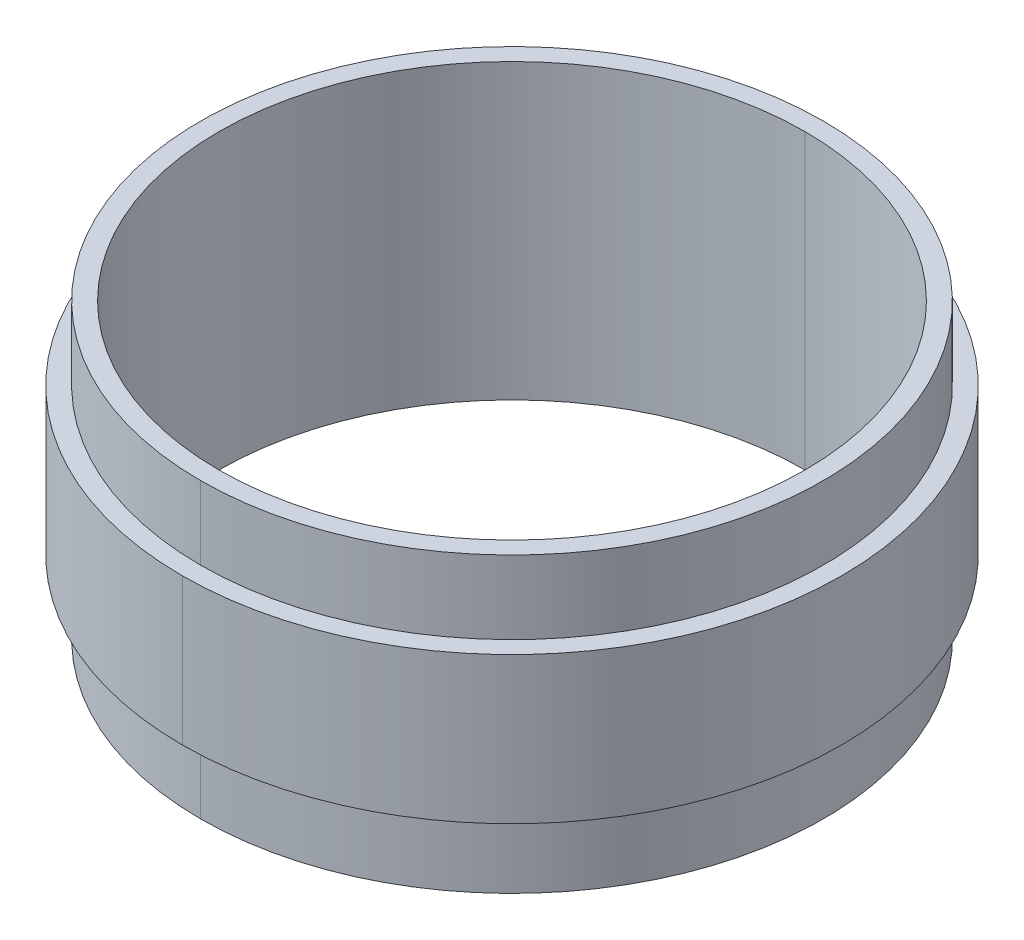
ISO-10303-21;
HEADER;
FILE_DESCRIPTION(('STEP AP214'),'2;1');
FILE_NAME('part.step','',(''),(''),'','','');
FILE_SCHEMA(('AUTOMOTIVE_DESIGN { 1 0 10303 214 1 1 1 1 }'));
ENDSEC;
DATA;
#1=APPLICATION_CONTEXT('core data for automotive mechanical design processes');
#2=APPLICATION_PROTOCOL_DEFINITION('international standard','automotive_design',2000,#1);
#3=PRODUCT_CONTEXT('',#1,'mechanical');
#4=PRODUCT('Part','Part','',(#3));
#5=PRODUCT_RELATED_PRODUCT_CATEGORY('part','',(#4));
#6=PRODUCT_DEFINITION_FORMATION('','',#4);
#7=PRODUCT_DEFINITION_CONTEXT('part definition',#1,'design');
#8=PRODUCT_DEFINITION('design','',#6,#7);
#9=PRODUCT_DEFINITION_SHAPE('','',#8);
#10=(LENGTH_UNIT() NAMED_UNIT(*) SI_UNIT(.MILLI.,.METRE.));
#11=(NAMED_UNIT(*) PLANE_ANGLE_UNIT() SI_UNIT($,.RADIAN.));
#12=(NAMED_UNIT(*) SI_UNIT($,.STERADIAN.) SOLID_ANGLE_UNIT());
#13=UNCERTAINTY_MEASURE_WITH_UNIT(LENGTH_MEASURE(1.E-05),#10,'distance_accuracy_value','');
#14=(GEOMETRIC_REPRESENTATION_CONTEXT(3) GLOBAL_UNCERTAINTY_ASSIGNED_CONTEXT((#13)) GLOBAL_UNIT_ASSIGNED_CONTEXT((#10,
#11,#12)) REPRESENTATION_CONTEXT('',''));
#15=CARTESIAN_POINT('',(0.,0.,0.));
#16=DIRECTION('',(0.,0.,1.));
#17=DIRECTION('',(1.,0.,0.));
#18=AXIS2_PLACEMENT_3D('',#15,#16,#17);
#19=CARTESIAN_POINT('',(0.,-500.,0.));
#20=DIRECTION('',(0.,-1.,0.));
#21=DIRECTION('',(0.,0.,-1.));
#22=AXIS2_PLACEMENT_3D('',#19,#20,#21);
#23=CYLINDRICAL_SURFACE('',#22,8.5);
#24=DIRECTION('',(0.,-1.,0.));
#25=VECTOR('',#24,1.);
#26=CARTESIAN_POINT('',(0.,-500.,8.5));
#27=LINE('',#26,#25);
#28=CARTESIAN_POINT('',(0.,-78.,8.5));
#29=VERTEX_POINT('',#28);
#30=CARTESIAN_POINT('',(0.,-80.,8.5));
#31=VERTEX_POINT('',#30);
#32=EDGE_CURVE('E174',#29,#31,#27,.T.);
#33=ORIENTED_EDGE('',*,*,#32,.F.);
#34=CARTESIAN_POINT('',(0.,-78.,0.));
#35=DIRECTION('',(0.,-1.,0.));
#36=DIRECTION('',(0.,0.,-1.));
#37=AXIS2_PLACEMENT_3D('',#34,#35,#36);
#38=CIRCLE('',#37,8.5);
#39=CARTESIAN_POINT('',(0.,-78.,-8.5));
#40=VERTEX_POINT('',#39);
#41=EDGE_CURVE('E10',#29,#40,#38,.T.);
#42=ORIENTED_EDGE('',*,*,#41,.T.);
#43=DIRECTION('',(0.,-1.,0.));
#44=VECTOR('',#43,1.);
#45=CARTESIAN_POINT('',(0.,-500.,-8.5));
#46=LINE('',#45,#44);
#47=CARTESIAN_POINT('',(0.,-80.,-8.5));
#48=VERTEX_POINT('',#47);
#49=EDGE_CURVE('E161',#40,#48,#46,.T.);
#50=ORIENTED_EDGE('',*,*,#49,.T.);
#51=CARTESIAN_POINT('',(0.,-80.,0.));
#52=DIRECTION('',(0.,-1.,0.));
#53=DIRECTION('',(0.,0.,-1.));
#54=AXIS2_PLACEMENT_3D('',#51,#52,#53);
#55=CIRCLE('',#54,8.5);
#56=EDGE_CURVE('E130',#31,#48,#55,.T.);
#57=ORIENTED_EDGE('',*,*,#56,.F.);
#58=EDGE_LOOP('',(#33,#42,#50,#57));
#59=FACE_BOUND('',#58,.T.);
#60=ADVANCED_FACE('F16',(#59),#23,.T.);
#61=CARTESIAN_POINT('',(9.,-78.,0.));
#62=DIRECTION('',(0.,-1.,0.));
#63=DIRECTION('',(-1.,0.,0.));
#64=AXIS2_PLACEMENT_3D('',#61,#62,#63);
#65=PLANE('',#64);
#66=CARTESIAN_POINT('',(0.,-78.,0.));
#67=DIRECTION('',(0.,-1.,0.));
#68=DIRECTION('',(0.,0.,-1.));
#69=AXIS2_PLACEMENT_3D('',#66,#67,#68);
#70=CIRCLE('',#69,8.5);
#71=EDGE_CURVE('E20',#40,#29,#70,.T.);
#72=ORIENTED_EDGE('',*,*,#71,.F.);
#73=ORIENTED_EDGE('',*,*,#41,.F.);
#74=EDGE_LOOP('',(#72,#73));
#75=FACE_BOUND('',#74,.T.);
#76=CARTESIAN_POINT('',(0.,-78.,0.));
#77=DIRECTION('',(0.,-1.,0.));
#78=DIRECTION('',(0.,0.,-1.));
#79=AXIS2_PLACEMENT_3D('',#76,#77,#78);
#80=CIRCLE('',#79,9.);
#81=CARTESIAN_POINT('',(0.,-78.,-9.));
#82=VERTEX_POINT('',#81);
#83=CARTESIAN_POINT('',(0.,-78.,9.));
#84=VERTEX_POINT('',#83);
#85=EDGE_CURVE('E126',#82,#84,#80,.T.);
#86=ORIENTED_EDGE('',*,*,#85,.T.);
#87=CARTESIAN_POINT('',(0.,-78.,0.));
#88=DIRECTION('',(0.,-1.,0.));
#89=DIRECTION('',(0.,0.,-1.));
#90=AXIS2_PLACEMENT_3D('',#87,#88,#89);
#91=CIRCLE('',#90,9.);
#92=EDGE_CURVE('E27',#84,#82,#91,.T.);
#93=ORIENTED_EDGE('',*,*,#92,.T.);
#94=EDGE_LOOP('',(#86,#93));
#95=FACE_BOUND('',#94,.T.);
#96=ADVANCED_FACE('F195',(#75,#95),#65,.T.);
#97=CARTESIAN_POINT('',(0.,-500.,0.));
#98=DIRECTION('',(0.,-1.,0.));
#99=DIRECTION('',(0.,0.,-1.));
#100=AXIS2_PLACEMENT_3D('',#97,#98,#99);
#101=CYLINDRICAL_SURFACE('',#100,9.);
#102=DIRECTION('',(0.,-1.,0.));
#103=VECTOR('',#102,1.);
#104=CARTESIAN_POINT('',(0.,-500.,9.));
#105=LINE('',#104,#103);
#106=CARTESIAN_POINT('',(0.,-74.,9.));
#107=VERTEX_POINT('',#106);
#108=EDGE_CURVE('E140',#107,#84,#105,.T.);
#109=ORIENTED_EDGE('',*,*,#108,.F.);
#110=CARTESIAN_POINT('',(0.,-74.,0.));
#111=DIRECTION('',(0.,-1.,0.));
#112=DIRECTION('',(0.,0.,-1.));
#113=AXIS2_PLACEMENT_3D('',#110,#111,#112);
#114=CIRCLE('',#113,9.);
#115=CARTESIAN_POINT('',(0.,-74.,-9.));
#116=VERTEX_POINT('',#115);
#117=EDGE_CURVE('E169',#107,#116,#114,.T.);
#118=ORIENTED_EDGE('',*,*,#117,.T.);
#119=DIRECTION('',(0.,-1.,0.));
#120=VECTOR('',#119,1.);
#121=CARTESIAN_POINT('',(0.,-500.,-9.));
#122=LINE('',#121,#120);
#123=EDGE_CURVE('E117',#116,#82,#122,.T.);
#124=ORIENTED_EDGE('',*,*,#123,.T.);
#125=ORIENTED_EDGE('',*,*,#92,.F.);
#126=EDGE_LOOP('',(#109,#118,#124,#125));
#127=FACE_BOUND('',#126,.T.);
#128=ADVANCED_FACE('F193',(#127),#101,.T.);
#129=CARTESIAN_POINT('',(8.5,-74.,0.));
#130=DIRECTION('',(0.,1.,0.));
#131=DIRECTION('',(0.,0.,-1.));
#132=AXIS2_PLACEMENT_3D('',#129,#130,#131);
#133=PLANE('',#132);
#134=CARTESIAN_POINT('',(0.,-74.,0.));
#135=DIRECTION('',(0.,-1.,0.));
#136=DIRECTION('',(0.,0.,-1.));
#137=AXIS2_PLACEMENT_3D('',#134,#135,#136);
#138=CIRCLE('',#137,9.);
#139=EDGE_CURVE('E164',#116,#107,#138,.T.);
#140=ORIENTED_EDGE('',*,*,#139,.F.);
#141=ORIENTED_EDGE('',*,*,#117,.F.);
#142=EDGE_LOOP('',(#140,#141));
#143=FACE_BOUND('',#142,.T.);
#144=CARTESIAN_POINT('',(0.,-74.,0.));
#145=DIRECTION('',(0.,-1.,0.));
#146=DIRECTION('',(0.,0.,-1.));
#147=AXIS2_PLACEMENT_3D('',#144,#145,#146);
#148=CIRCLE('',#147,8.5);
#149=CARTESIAN_POINT('',(0.,-74.,-8.5));
#150=VERTEX_POINT('',#149);
#151=CARTESIAN_POINT('',(0.,-74.,8.5));
#152=VERTEX_POINT('',#151);
#153=EDGE_CURVE('E110',#150,#152,#148,.T.);
#154=ORIENTED_EDGE('',*,*,#153,.T.);
#155=CARTESIAN_POINT('',(0.,-74.,0.));
#156=DIRECTION('',(0.,-1.,0.));
#157=DIRECTION('',(0.,0.,-1.));
#158=AXIS2_PLACEMENT_3D('',#155,#156,#157);
#159=CIRCLE('',#158,8.5);
#160=EDGE_CURVE('E103',#152,#150,#159,.T.);
#161=ORIENTED_EDGE('',*,*,#160,.T.);
#162=EDGE_LOOP('',(#154,#161));
#163=FACE_BOUND('',#162,.T.);
#164=ADVANCED_FACE('F204',(#143,#163),#133,.T.);
#165=CARTESIAN_POINT('',(0.,-500.,0.));
#166=DIRECTION('',(0.,-1.,0.));
#167=DIRECTION('',(0.,0.,-1.));
#168=AXIS2_PLACEMENT_3D('',#165,#166,#167);
#169=CYLINDRICAL_SURFACE('',#168,8.5);
#170=DIRECTION('',(0.,-1.,0.));
#171=VECTOR('',#170,1.);
#172=CARTESIAN_POINT('',(0.,-500.,8.5));
#173=LINE('',#172,#171);
#174=CARTESIAN_POINT('',(0.,-72.,8.5));
#175=VERTEX_POINT('',#174);
#176=EDGE_CURVE('E98',#175,#152,#173,.T.);
#177=ORIENTED_EDGE('',*,*,#176,.F.);
#178=CARTESIAN_POINT('',(0.,-72.,0.));
#179=DIRECTION('',(0.,-1.,0.));
#180=DIRECTION('',(0.,0.,-1.));
#181=AXIS2_PLACEMENT_3D('',#178,#179,#180);
#182=CIRCLE('',#181,8.5);
#183=CARTESIAN_POINT('',(0.,-72.,-8.5));
#184=VERTEX_POINT('',#183);
#185=EDGE_CURVE('E91',#175,#184,#182,.T.);
#186=ORIENTED_EDGE('',*,*,#185,.T.);
#187=DIRECTION('',(0.,-1.,0.));
#188=VECTOR('',#187,1.);
#189=CARTESIAN_POINT('',(0.,-500.,-8.5));
#190=LINE('',#189,#188);
#191=EDGE_CURVE('E95',#184,#150,#190,.T.);
#192=ORIENTED_EDGE('',*,*,#191,.T.);
#193=ORIENTED_EDGE('',*,*,#160,.F.);
#194=EDGE_LOOP('',(#177,#186,#192,#193));
#195=FACE_BOUND('',#194,.T.);
#196=ADVANCED_FACE('F93',(#195),#169,.T.);
#197=CARTESIAN_POINT('',(8.,-72.,0.));
#198=DIRECTION('',(0.,1.,0.));
#199=DIRECTION('',(0.,0.,-1.));
#200=AXIS2_PLACEMENT_3D('',#197,#198,#199);
#201=PLANE('',#200);
#202=CARTESIAN_POINT('',(0.,-72.,0.));
#203=DIRECTION('',(0.,-1.,0.));
#204=DIRECTION('',(0.,0.,-1.));
#205=AXIS2_PLACEMENT_3D('',#202,#203,#204);
#206=CIRCLE('',#205,8.5);
#207=EDGE_CURVE('E108',#184,#175,#206,.T.);
#208=ORIENTED_EDGE('',*,*,#207,.F.);
#209=ORIENTED_EDGE('',*,*,#185,.F.);
#210=EDGE_LOOP('',(#208,#209));
#211=FACE_BOUND('',#210,.T.);
#212=CARTESIAN_POINT('',(0.,-72.,0.));
#213=DIRECTION('',(0.,-1.,0.));
#214=DIRECTION('',(0.,0.,-1.));
#215=AXIS2_PLACEMENT_3D('',#212,#213,#214);
#216=CIRCLE('',#215,8.);
#217=CARTESIAN_POINT('',(0.,-72.,-8.));
#218=VERTEX_POINT('',#217);
#219=CARTESIAN_POINT('',(0.,-72.,8.));
#220=VERTEX_POINT('',#219);
#221=EDGE_CURVE('E104',#218,#220,#216,.T.);
#222=ORIENTED_EDGE('',*,*,#221,.T.);
#223=CARTESIAN_POINT('',(0.,-72.,0.));
#224=DIRECTION('',(0.,-1.,0.));
#225=DIRECTION('',(0.,0.,-1.));
#226=AXIS2_PLACEMENT_3D('',#223,#224,#225);
#227=CIRCLE('',#226,8.);
#228=EDGE_CURVE('E112',#220,#218,#227,.T.);
#229=ORIENTED_EDGE('',*,*,#228,.T.);
#230=EDGE_LOOP('',(#222,#229));
#231=FACE_BOUND('',#230,.T.);
#232=ADVANCED_FACE('F114',(#211,#231),#201,.T.);
#233=CARTESIAN_POINT('',(0.,-500.,0.));
#234=DIRECTION('',(0.,-1.,0.));
#235=DIRECTION('',(0.,0.,-1.));
#236=AXIS2_PLACEMENT_3D('',#233,#234,#235);
#237=CYLINDRICAL_SURFACE('',#236,8.);
#238=DIRECTION('',(0.,-1.,0.));
#239=VECTOR('',#238,1.);
#240=CARTESIAN_POINT('',(0.,-500.,8.));
#241=LINE('',#240,#239);
#242=CARTESIAN_POINT('',(0.,-80.,8.));
#243=VERTEX_POINT('',#242);
#244=EDGE_CURVE('E135',#220,#243,#241,.T.);
#245=ORIENTED_EDGE('',*,*,#244,.F.);
#246=ORIENTED_EDGE('',*,*,#221,.F.);
#247=DIRECTION('',(0.,-1.,0.));
#248=VECTOR('',#247,1.);
#249=CARTESIAN_POINT('',(0.,-500.,-8.));
#250=LINE('',#249,#248);
#251=CARTESIAN_POINT('',(0.,-80.,-8.));
#252=VERTEX_POINT('',#251);
#253=EDGE_CURVE('E141',#218,#252,#250,.T.);
#254=ORIENTED_EDGE('',*,*,#253,.T.);
#255=CARTESIAN_POINT('',(0.,-80.,0.));
#256=DIRECTION('',(0.,-1.,0.));
#257=DIRECTION('',(0.,0.,-1.));
#258=AXIS2_PLACEMENT_3D('',#255,#256,#257);
#259=CIRCLE('',#258,8.);
#260=EDGE_CURVE('E40',#252,#243,#259,.T.);
#261=ORIENTED_EDGE('',*,*,#260,.T.);
#262=EDGE_LOOP('',(#245,#246,#254,#261));
#263=FACE_BOUND('',#262,.T.);
#264=ADVANCED_FACE('F211',(#263),#237,.F.);
#265=CARTESIAN_POINT('',(8.5,-80.,0.));
#266=DIRECTION('',(0.,-1.,0.));
#267=DIRECTION('',(-1.,0.,0.));
#268=AXIS2_PLACEMENT_3D('',#265,#266,#267);
#269=PLANE('',#268);
#270=ORIENTED_EDGE('',*,*,#260,.F.);
#271=CARTESIAN_POINT('',(0.,-80.,0.));
#272=DIRECTION('',(0.,-1.,0.));
#273=DIRECTION('',(0.,0.,-1.));
#274=AXIS2_PLACEMENT_3D('',#271,#272,#273);
#275=CIRCLE('',#274,8.);
#276=EDGE_CURVE('E144',#243,#252,#275,.T.);
#277=ORIENTED_EDGE('',*,*,#276,.F.);
#278=EDGE_LOOP('',(#270,#277));
#279=FACE_BOUND('',#278,.T.);
#280=CARTESIAN_POINT('',(0.,-80.,0.));
#281=DIRECTION('',(0.,-1.,0.));
#282=DIRECTION('',(0.,0.,-1.));
#283=AXIS2_PLACEMENT_3D('',#280,#281,#282);
#284=CIRCLE('',#283,8.5);
#285=EDGE_CURVE('E165',#48,#31,#284,.T.);
#286=ORIENTED_EDGE('',*,*,#285,.T.);
#287=ORIENTED_EDGE('',*,*,#56,.T.);
#288=EDGE_LOOP('',(#286,#287));
#289=FACE_BOUND('',#288,.T.);
#290=ADVANCED_FACE('F210',(#279,#289),#269,.T.);
#291=CARTESIAN_POINT('',(0.,-500.,0.));
#292=DIRECTION('',(0.,-1.,0.));
#293=DIRECTION('',(0.,0.,-1.));
#294=AXIS2_PLACEMENT_3D('',#291,#292,#293);
#295=CYLINDRICAL_SURFACE('',#294,8.);
#296=ORIENTED_EDGE('',*,*,#228,.F.);
#297=ORIENTED_EDGE('',*,*,#244,.T.);
#298=ORIENTED_EDGE('',*,*,#276,.T.);
#299=ORIENTED_EDGE('',*,*,#253,.F.);
#300=EDGE_LOOP('',(#296,#297,#298,#299));
#301=FACE_BOUND('',#300,.T.);
#302=ADVANCED_FACE('F215',(#301),#295,.F.);
#303=CARTESIAN_POINT('',(0.,-500.,0.));
#304=DIRECTION('',(0.,-1.,0.));
#305=DIRECTION('',(0.,0.,-1.));
#306=AXIS2_PLACEMENT_3D('',#303,#304,#305);
#307=CYLINDRICAL_SURFACE('',#306,8.5);
#308=ORIENTED_EDGE('',*,*,#207,.T.);
#309=ORIENTED_EDGE('',*,*,#176,.T.);
#310=ORIENTED_EDGE('',*,*,#153,.F.);
#311=ORIENTED_EDGE('',*,*,#191,.F.);
#312=EDGE_LOOP('',(#308,#309,#310,#311));
#313=FACE_BOUND('',#312,.T.);
#314=ADVANCED_FACE('F107',(#313),#307,.T.);
#315=CARTESIAN_POINT('',(0.,-500.,0.));
#316=DIRECTION('',(0.,-1.,0.));
#317=DIRECTION('',(0.,0.,-1.));
#318=AXIS2_PLACEMENT_3D('',#315,#316,#317);
#319=CYLINDRICAL_SURFACE('',#318,9.);
#320=ORIENTED_EDGE('',*,*,#139,.T.);
#321=ORIENTED_EDGE('',*,*,#108,.T.);
#322=ORIENTED_EDGE('',*,*,#85,.F.);
#323=ORIENTED_EDGE('',*,*,#123,.F.);
#324=EDGE_LOOP('',(#320,#321,#322,#323));
#325=FACE_BOUND('',#324,.T.);
#326=ADVANCED_FACE('F189',(#325),#319,.T.);
#327=CARTESIAN_POINT('',(0.,-500.,0.));
#328=DIRECTION('',(0.,-1.,0.));
#329=DIRECTION('',(0.,0.,-1.));
#330=AXIS2_PLACEMENT_3D('',#327,#328,#329);
#331=CYLINDRICAL_SURFACE('',#330,8.5);
#332=ORIENTED_EDGE('',*,*,#71,.T.);
#333=ORIENTED_EDGE('',*,*,#32,.T.);
#334=ORIENTED_EDGE('',*,*,#285,.F.);
#335=ORIENTED_EDGE('',*,*,#49,.F.);
#336=EDGE_LOOP('',(#332,#333,#334,#335));
#337=FACE_BOUND('',#336,.T.);
#338=ADVANCED_FACE('F18',(#337),#331,.T.);
#339=CLOSED_SHELL('',(#60,#96,#128,#164,#196,#232,#264,#290,#302,#314,#326,#338));
#340=MANIFOLD_SOLID_BREP('B1',#339);
#341=ADVANCED_BREP_SHAPE_REPRESENTATION('',(#18,#340),#14);
#342=SHAPE_DEFINITION_REPRESENTATION(#9,#341);
ENDSEC;
END-ISO-10303-21;
